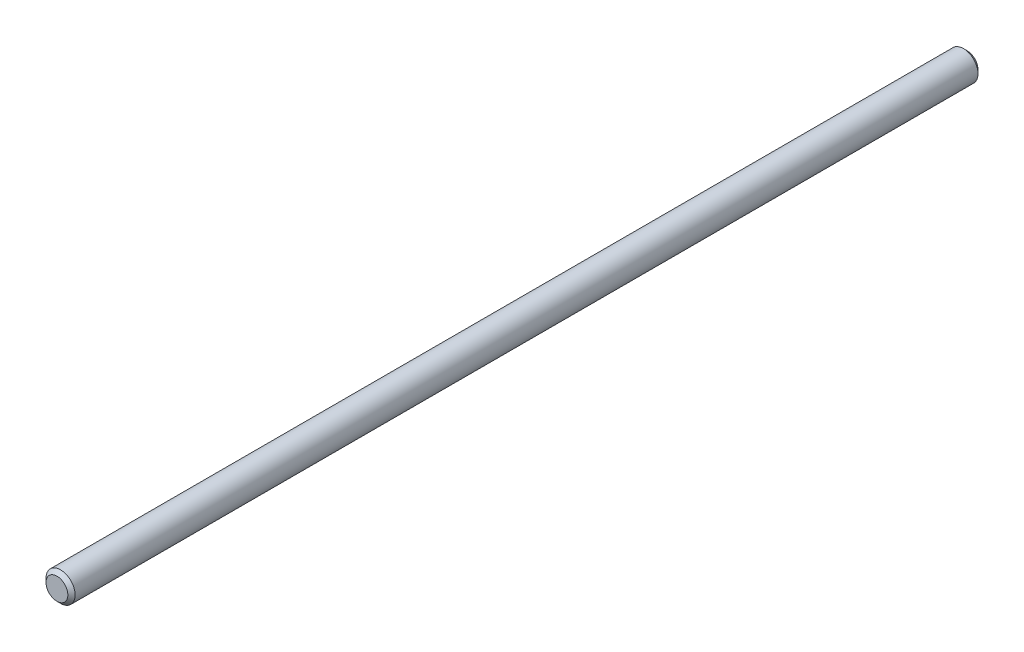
ISO-10303-21;
HEADER;
FILE_DESCRIPTION(('STEP AP214'),'2;1');
FILE_NAME('part.step','',(''),(''),'','','');
FILE_SCHEMA(('AUTOMOTIVE_DESIGN { 1 0 10303 214 1 1 1 1 }'));
ENDSEC;
DATA;
#1=APPLICATION_CONTEXT('core data for automotive mechanical design processes');
#2=APPLICATION_PROTOCOL_DEFINITION('international standard','automotive_design',2000,#1);
#3=PRODUCT_CONTEXT('',#1,'mechanical');
#4=PRODUCT('Part','Part','',(#3));
#5=PRODUCT_RELATED_PRODUCT_CATEGORY('part','',(#4));
#6=PRODUCT_DEFINITION_FORMATION('','',#4);
#7=PRODUCT_DEFINITION_CONTEXT('part definition',#1,'design');
#8=PRODUCT_DEFINITION('design','',#6,#7);
#9=PRODUCT_DEFINITION_SHAPE('','',#8);
#10=(LENGTH_UNIT() NAMED_UNIT(*) SI_UNIT(.MILLI.,.METRE.));
#11=(NAMED_UNIT(*) PLANE_ANGLE_UNIT() SI_UNIT($,.RADIAN.));
#12=(NAMED_UNIT(*) SI_UNIT($,.STERADIAN.) SOLID_ANGLE_UNIT());
#13=UNCERTAINTY_MEASURE_WITH_UNIT(LENGTH_MEASURE(1.E-05),#10,'distance_accuracy_value','');
#14=(GEOMETRIC_REPRESENTATION_CONTEXT(3) GLOBAL_UNCERTAINTY_ASSIGNED_CONTEXT((#13)) GLOBAL_UNIT_ASSIGNED_CONTEXT((#10,
#11,#12)) REPRESENTATION_CONTEXT('',''));
#15=CARTESIAN_POINT('',(0.,0.,0.));
#16=DIRECTION('',(0.,0.,1.));
#17=DIRECTION('',(1.,0.,0.));
#18=AXIS2_PLACEMENT_3D('',#15,#16,#17);
#19=CARTESIAN_POINT('',(0.,0.,-125.));
#20=DIRECTION('',(0.,0.,1.));
#21=DIRECTION('',(1.,0.,0.));
#22=AXIS2_PLACEMENT_3D('',#19,#20,#21);
#23=CYLINDRICAL_SURFACE('',#22,2.);
#24=CARTESIAN_POINT('',(0.,0.,-124.5));
#25=DIRECTION('',(0.,0.,1.));
#26=DIRECTION('',(1.,0.,0.));
#27=AXIS2_PLACEMENT_3D('',#24,#25,#26);
#28=CIRCLE('',#27,2.);
#29=CARTESIAN_POINT('',(2.,0.,-124.5));
#30=VERTEX_POINT('',#29);
#31=EDGE_CURVE('E43',#30,#30,#28,.T.);
#32=ORIENTED_EDGE('',*,*,#31,.T.);
#33=EDGE_LOOP('',(#32));
#34=FACE_BOUND('',#33,.T.);
#35=CARTESIAN_POINT('',(0.,0.,-0.5));
#36=DIRECTION('',(0.,0.,1.));
#37=DIRECTION('',(1.,0.,0.));
#38=AXIS2_PLACEMENT_3D('',#35,#36,#37);
#39=CIRCLE('',#38,2.);
#40=CARTESIAN_POINT('',(2.,0.,-0.5));
#41=VERTEX_POINT('',#40);
#42=EDGE_CURVE('E47',#41,#41,#39,.F.);
#43=ORIENTED_EDGE('',*,*,#42,.T.);
#44=EDGE_LOOP('',(#43));
#45=FACE_BOUND('',#44,.T.);
#46=ADVANCED_FACE('F32',(#34,#45),#23,.T.);
#47=CARTESIAN_POINT('',(0.,0.,-125.));
#48=DIRECTION('',(0.,0.,1.));
#49=DIRECTION('',(1.,0.,0.));
#50=AXIS2_PLACEMENT_3D('',#47,#48,#49);
#51=PLANE('',#50);
#52=CARTESIAN_POINT('',(0.,0.,-125.));
#53=DIRECTION('',(0.,0.,1.));
#54=DIRECTION('',(1.,0.,0.));
#55=AXIS2_PLACEMENT_3D('',#52,#53,#54);
#56=CIRCLE('',#55,1.5);
#57=CARTESIAN_POINT('',(1.5,0.,-125.));
#58=VERTEX_POINT('',#57);
#59=EDGE_CURVE('E39',#58,#58,#56,.F.);
#60=ORIENTED_EDGE('',*,*,#59,.T.);
#61=EDGE_LOOP('',(#60));
#62=FACE_BOUND('',#61,.T.);
#63=ADVANCED_FACE('F63',(#62),#51,.F.);
#64=CARTESIAN_POINT('',(0.,0.,0.));
#65=DIRECTION('',(0.,0.,1.));
#66=DIRECTION('',(1.,0.,0.));
#67=AXIS2_PLACEMENT_3D('',#64,#65,#66);
#68=PLANE('',#67);
#69=CARTESIAN_POINT('',(0.,0.,0.));
#70=DIRECTION('',(0.,0.,1.));
#71=DIRECTION('',(1.,0.,0.));
#72=AXIS2_PLACEMENT_3D('',#69,#70,#71);
#73=CIRCLE('',#72,1.49999999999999);
#74=CARTESIAN_POINT('',(1.49999999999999,0.,0.));
#75=VERTEX_POINT('',#74);
#76=EDGE_CURVE('E10',#75,#75,#73,.T.);
#77=ORIENTED_EDGE('',*,*,#76,.T.);
#78=EDGE_LOOP('',(#77));
#79=FACE_BOUND('',#78,.T.);
#80=ADVANCED_FACE('F60',(#79),#68,.T.);
#81=CARTESIAN_POINT('',(0.,0.,-124.5));
#82=DIRECTION('',(0.,0.,1.));
#83=DIRECTION('',(1.,0.,0.));
#84=AXIS2_PLACEMENT_3D('',#81,#82,#83);
#85=CONICAL_SURFACE('',#84,2.,0.785398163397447);
#86=ORIENTED_EDGE('',*,*,#59,.F.);
#87=EDGE_LOOP('',(#86));
#88=FACE_BOUND('',#87,.T.);
#89=ORIENTED_EDGE('',*,*,#31,.F.);
#90=EDGE_LOOP('',(#89));
#91=FACE_BOUND('',#90,.T.);
#92=ADVANCED_FACE('F56',(#88,#91),#85,.T.);
#93=CARTESIAN_POINT('',(0.,0.,0.));
#94=DIRECTION('',(0.,0.,-1.));
#95=DIRECTION('',(-1.,0.,0.));
#96=AXIS2_PLACEMENT_3D('',#93,#94,#95);
#97=CONICAL_SURFACE('',#96,1.49999999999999,0.78539816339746);
#98=ORIENTED_EDGE('',*,*,#42,.F.);
#99=EDGE_LOOP('',(#98));
#100=FACE_BOUND('',#99,.T.);
#101=ORIENTED_EDGE('',*,*,#76,.F.);
#102=EDGE_LOOP('',(#101));
#103=FACE_BOUND('',#102,.T.);
#104=ADVANCED_FACE('F34',(#100,#103),#97,.T.);
#105=CLOSED_SHELL('',(#46,#63,#80,#92,#104));
#106=MANIFOLD_SOLID_BREP('B2',#105);
#107=ADVANCED_BREP_SHAPE_REPRESENTATION('',(#18,#106),#14);
#108=SHAPE_DEFINITION_REPRESENTATION(#9,#107);
ENDSEC;
END-ISO-10303-21;
